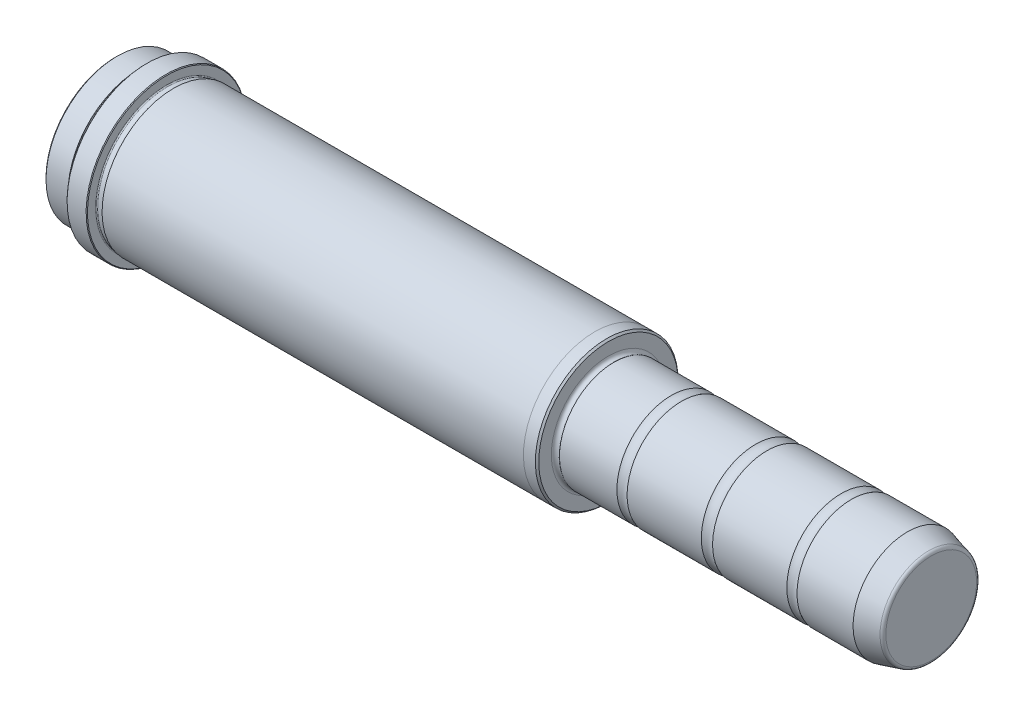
from build123d import *

# Parameters (mm, degrees)
FILLET1_R     = 1
CHAMFER1_SIZE = 0.2
CHAMFER2_SIZE = 0.5


with BuildPart() as part:
    # Sketch1 → Revolve1 (revolve)
    with BuildSketch(Plane.XY):
        with BuildLine():
            Line((95, 14.124355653), (88, 16))
            Line((88, 16), (1.6, 16))
            ThreePointArc((1.6, 16), (0.552786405, 15.905572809), (0, 16.8))
            Line((0, 16.8), (0, 21))
            Line((0, 21), (-4, 21))
            Line((-4, 21), (-128, 21.0001))
            Line((-128, 21.0001), (-128, 20.9))
            ThreePointArc((-128, 20.9), (-128.087867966, 20.687867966), (-128.3, 20.6))
            Line((-128.3, 20.6), (-129.7, 20.6))
            ThreePointArc((-129.7, 20.6), (-129.912132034, 20.687867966), (-130, 20.9))
            Line((-130, 20.9), (-130, 23.5))
            Line((-130, 23.5), (-136, 23.5))
            Line((-136, 23.5), (-136, 20.9))
            ThreePointArc((-136, 20.9), (-136.087867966, 20.687867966), (-136.3, 20.6))
            Line((-136.3, 20.6), (-137.7, 20.6))
            ThreePointArc((-137.7, 20.6), (-137.912132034, 20.687867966), (-138, 20.9))
            Line((-138, 20.9), (-138, 21))
            Line((-138, 21), (-145, 21))
            Line((-145, 21), (-145, 0))
            Line((-145, 0), (95, 0))
            Line((95, 0), (95, 14.124355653))
        make_face()
    revolve(axis=Axis((95, 0, 0), (-1, 0, 0)))

    # Sketch2 → Groove A (revolve, cut)
    with BuildSketch(Plane.XY):
        with BuildLine():
            Line((68.503337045, 16), (71.496662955, 16))
            ThreePointArc((71.496662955, 16), (70, 15.6), (68.503337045, 16))
        make_face()
    revolve(axis=Axis((95, 0, 0), (1, 0, 0)), mode=Mode.SUBTRACT)

    # Sketch3 → Groove B (revolve, cut)
    with BuildSketch(Plane.XY, mode=Mode.PRIVATE) as groove_b_sk:
        with BuildLine():
            Line((43.341687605, 16), (46.658312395, 16))
            ThreePointArc((46.658312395, 16), (45, 15.5), (43.341687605, 16))
        make_face()
    revolve(groove_b_sk.sketch.rotate(Axis((95, 0, 0), (1, 0, 0)), 180), axis=Axis((95, 0, 0), (1, 0, 0)), mode=Mode.SUBTRACT)

    # Sketch4 → Groove C (revolve, cut)
    with BuildSketch(Plane.XY, mode=Mode.PRIVATE) as groove_c_sk:
        with BuildLine():
            Line((18.503337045, 16), (21.496662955, 16))
            ThreePointArc((21.496662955, 16), (20, 15.6), (18.503337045, 16))
        make_face()
    revolve(groove_c_sk.sketch.rotate(Axis((95, 0, 0), (1, 0, 0)), 180), axis=Axis((95, 0, 0), (1, 0, 0)), mode=Mode.SUBTRACT)

    # Fillet1
    fillet1_edges = [part.edges().sort_by_distance(p)[0] for p in [
        (95, -14.124355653, 0),
    ]]
    fillet(fillet1_edges, radius=FILLET1_R)

    # Chamfer1
    chamfer1_edges = [part.edges().sort_by_distance(p)[0] for p in [
        (-130, -23.5, 0),
        (-136, -23.5, 0),
    ]]
    chamfer(chamfer1_edges, length=CHAMFER1_SIZE)

    # Chamfer2
    chamfer2_edges = [part.edges().sort_by_distance(p)[0] for p in [
        (0, -21, 0),
        (-145, -21, 0),
    ]]
    chamfer(chamfer2_edges, length=CHAMFER2_SIZE)


solid = part.part
